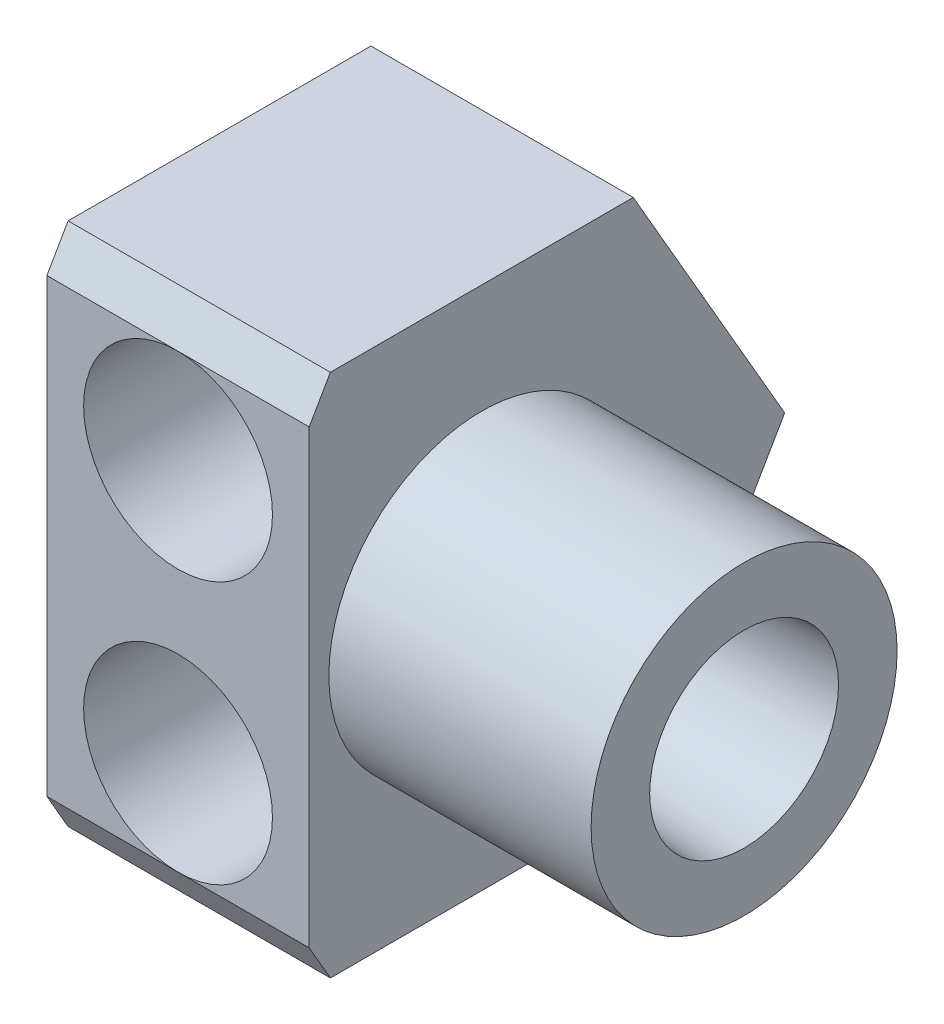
ISO-10303-21;
HEADER;
FILE_DESCRIPTION(('STEP AP214'),'2;1');
FILE_NAME('part.step','',(''),(''),'','','');
FILE_SCHEMA(('AUTOMOTIVE_DESIGN { 1 0 10303 214 1 1 1 1 }'));
ENDSEC;
DATA;
#1=APPLICATION_CONTEXT('core data for automotive mechanical design processes');
#2=APPLICATION_PROTOCOL_DEFINITION('international standard','automotive_design',2000,#1);
#3=PRODUCT_CONTEXT('',#1,'mechanical');
#4=PRODUCT('Part','Part','',(#3));
#5=PRODUCT_RELATED_PRODUCT_CATEGORY('part','',(#4));
#6=PRODUCT_DEFINITION_FORMATION('','',#4);
#7=PRODUCT_DEFINITION_CONTEXT('part definition',#1,'design');
#8=PRODUCT_DEFINITION('design','',#6,#7);
#9=PRODUCT_DEFINITION_SHAPE('','',#8);
#10=(LENGTH_UNIT() NAMED_UNIT(*) SI_UNIT(.MILLI.,.METRE.));
#11=(NAMED_UNIT(*) PLANE_ANGLE_UNIT() SI_UNIT($,.RADIAN.));
#12=(NAMED_UNIT(*) SI_UNIT($,.STERADIAN.) SOLID_ANGLE_UNIT());
#13=UNCERTAINTY_MEASURE_WITH_UNIT(LENGTH_MEASURE(1.E-05),#10,'distance_accuracy_value','');
#14=(GEOMETRIC_REPRESENTATION_CONTEXT(3) GLOBAL_UNCERTAINTY_ASSIGNED_CONTEXT((#13)) GLOBAL_UNIT_ASSIGNED_CONTEXT((#10,
#11,#12)) REPRESENTATION_CONTEXT('',''));
#15=CARTESIAN_POINT('',(0.,0.,0.));
#16=DIRECTION('',(0.,0.,1.));
#17=DIRECTION('',(1.,0.,0.));
#18=AXIS2_PLACEMENT_3D('',#15,#16,#17);
#19=CARTESIAN_POINT('',(9.525,9.525,-5.01171935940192));
#20=DIRECTION('',(0.,0.,1.));
#21=DIRECTION('',(0.,-1.,0.));
#22=AXIS2_PLACEMENT_3D('',#19,#20,#21);
#23=CONICAL_SURFACE('',#22,5.83094591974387,1.02747003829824);
#24=CARTESIAN_POINT('',(9.525,9.52500000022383,-8.53337833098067));
#25=VERTEX_POINT('',#24);
#26=VERTEX_LOOP('',#25);
#27=FACE_BOUND('',#26,.T.);
#28=CARTESIAN_POINT('',(9.525,9.525,-5.01171935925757));
#29=DIRECTION('',(0.,0.,1.));
#30=DIRECTION('',(0.,-1.,0.));
#31=AXIS2_PLACEMENT_3D('',#28,#29,#30);
#32=CIRCLE('',#31,5.83094591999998);
#33=CARTESIAN_POINT('',(9.525,3.69405408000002,-5.01171935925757));
#34=VERTEX_POINT('',#33);
#35=EDGE_CURVE('E189',#34,#34,#32,.T.);
#36=ORIENTED_EDGE('',*,*,#35,.T.);
#37=EDGE_LOOP('',(#36));
#38=FACE_BOUND('',#37,.T.);
#39=ADVANCED_FACE('F16',(#27,#38),#23,.F.);
#40=CARTESIAN_POINT('',(9.525,-9.525,-5.01171937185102));
#41=DIRECTION('',(0.,0.,1.));
#42=DIRECTION('',(1.,0.,0.));
#43=AXIS2_PLACEMENT_3D('',#40,#41,#42);
#44=CONICAL_SURFACE('',#43,5.8309459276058,1.02747003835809);
#45=CARTESIAN_POINT('',(9.525,-9.525,-8.53337834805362));
#46=VERTEX_POINT('',#45);
#47=VERTEX_LOOP('',#46);
#48=FACE_BOUND('',#47,.T.);
#49=CARTESIAN_POINT('',(9.525,-9.525,-5.01171935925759));
#50=DIRECTION('',(0.,0.,-1.));
#51=DIRECTION('',(0.,1.,0.));
#52=AXIS2_PLACEMENT_3D('',#49,#50,#51);
#53=CIRCLE('',#52,5.83094592);
#54=CARTESIAN_POINT('',(9.525,-3.69405408,-5.01171935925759));
#55=VERTEX_POINT('',#54);
#56=EDGE_CURVE('E186',#55,#55,#53,.F.);
#57=ORIENTED_EDGE('',*,*,#56,.T.);
#58=EDGE_LOOP('',(#57));
#59=FACE_BOUND('',#58,.T.);
#60=ADVANCED_FACE('F375',(#48,#59),#44,.F.);
#61=CARTESIAN_POINT('',(9.525,9.525,20.8181197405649));
#62=DIRECTION('',(0.,0.,1.));
#63=DIRECTION('',(0.,-1.,0.));
#64=AXIS2_PLACEMENT_3D('',#61,#62,#63);
#65=CYLINDRICAL_SURFACE('',#64,5.83094591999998);
#66=CARTESIAN_POINT('',(9.525,9.525,-2.56732186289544));
#67=DIRECTION('',(0.,0.,1.));
#68=DIRECTION('',(0.,-1.,0.));
#69=AXIS2_PLACEMENT_3D('',#66,#67,#68);
#70=CIRCLE('',#69,5.83094591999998);
#71=CARTESIAN_POINT('',(9.525,3.69405408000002,-2.56732186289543));
#72=VERTEX_POINT('',#71);
#73=EDGE_CURVE('E19',#72,#72,#70,.F.);
#74=ORIENTED_EDGE('',*,*,#73,.F.);
#75=EDGE_LOOP('',(#74));
#76=FACE_BOUND('',#75,.T.);
#77=ORIENTED_EDGE('',*,*,#35,.F.);
#78=EDGE_LOOP('',(#77));
#79=FACE_BOUND('',#78,.T.);
#80=ADVANCED_FACE('F273',(#76,#79),#65,.F.);
#81=CARTESIAN_POINT('',(9.525,-9.525,20.8181197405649));
#82=DIRECTION('',(0.,0.,-1.));
#83=DIRECTION('',(0.,1.,0.));
#84=AXIS2_PLACEMENT_3D('',#81,#82,#83);
#85=CYLINDRICAL_SURFACE('',#84,5.83094592);
#86=CARTESIAN_POINT('',(9.525,-9.525,-2.56732186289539));
#87=DIRECTION('',(0.,0.,-1.));
#88=DIRECTION('',(0.,1.,0.));
#89=AXIS2_PLACEMENT_3D('',#86,#87,#88);
#90=CIRCLE('',#89,5.83094592);
#91=CARTESIAN_POINT('',(9.525,-3.69405408,-2.56732186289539));
#92=VERTEX_POINT('',#91);
#93=EDGE_CURVE('E180',#92,#92,#90,.T.);
#94=ORIENTED_EDGE('',*,*,#93,.F.);
#95=EDGE_LOOP('',(#94));
#96=FACE_BOUND('',#95,.T.);
#97=ORIENTED_EDGE('',*,*,#56,.F.);
#98=EDGE_LOOP('',(#97));
#99=FACE_BOUND('',#98,.T.);
#100=ADVANCED_FACE('F262',(#96,#99),#85,.F.);
#101=CARTESIAN_POINT('',(9.525,15.3559459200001,-2.56732186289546));
#102=DIRECTION('',(0.,0.,1.));
#103=DIRECTION('',(1.,0.,0.));
#104=AXIS2_PLACEMENT_3D('',#101,#102,#103);
#105=PLANE('',#104);
#106=ORIENTED_EDGE('',*,*,#73,.T.);
#107=EDGE_LOOP('',(#106));
#108=FACE_BOUND('',#107,.T.);
#109=DIRECTION('',(1.,0.,0.));
#110=VECTOR('',#109,1.);
#111=CARTESIAN_POINT('',(57.,3.02652193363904,-2.56732186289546));
#112=LINE('',#111,#110);
#113=CARTESIAN_POINT('',(7.33366551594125,3.026521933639,-2.56732186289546));
#114=VERTEX_POINT('',#113);
#115=CARTESIAN_POINT('',(11.7163344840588,3.02652193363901,-2.5673218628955));
#116=VERTEX_POINT('',#115);
#117=EDGE_CURVE('E126',#114,#116,#112,.T.);
#118=ORIENTED_EDGE('',*,*,#117,.T.);
#119=CARTESIAN_POINT('',(9.525,9.525,-2.56732186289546));
#120=DIRECTION('',(0.,0.,1.));
#121=DIRECTION('',(0.,-1.,0.));
#122=AXIS2_PLACEMENT_3D('',#119,#120,#121);
#123=CIRCLE('',#122,6.858);
#124=EDGE_CURVE('E254',#116,#114,#123,.T.);
#125=ORIENTED_EDGE('',*,*,#124,.T.);
#126=EDGE_LOOP('',(#118,#125));
#127=FACE_BOUND('',#126,.T.);
#128=ADVANCED_FACE('F258',(#108,#127),#105,.T.);
#129=CARTESIAN_POINT('',(9.525,-2.667,-2.56732186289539));
#130=DIRECTION('',(0.,0.,1.));
#131=DIRECTION('',(1.,0.,0.));
#132=AXIS2_PLACEMENT_3D('',#129,#130,#131);
#133=PLANE('',#132);
#134=ORIENTED_EDGE('',*,*,#93,.T.);
#135=EDGE_LOOP('',(#134));
#136=FACE_BOUND('',#135,.T.);
#137=DIRECTION('',(1.,0.,0.));
#138=VECTOR('',#137,1.);
#139=CARTESIAN_POINT('',(57.,-3.0265219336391,-2.56732186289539));
#140=LINE('',#139,#138);
#141=CARTESIAN_POINT('',(11.7163344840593,-3.0265219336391,-2.56732186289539));
#142=VERTEX_POINT('',#141);
#143=CARTESIAN_POINT('',(7.33366551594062,-3.02652193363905,-2.56732186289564));
#144=VERTEX_POINT('',#143);
#145=EDGE_CURVE('E127',#142,#144,#140,.F.);
#146=ORIENTED_EDGE('',*,*,#145,.T.);
#147=CARTESIAN_POINT('',(9.525,-9.525,-2.56732186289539));
#148=DIRECTION('',(0.,0.,1.));
#149=DIRECTION('',(0.,-1.,0.));
#150=AXIS2_PLACEMENT_3D('',#147,#148,#149);
#151=CIRCLE('',#150,6.85800000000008);
#152=EDGE_CURVE('E130',#144,#142,#151,.T.);
#153=ORIENTED_EDGE('',*,*,#152,.T.);
#154=EDGE_LOOP('',(#146,#153));
#155=FACE_BOUND('',#154,.T.);
#156=ADVANCED_FACE('F261',(#136,#155),#133,.T.);
#157=CARTESIAN_POINT('',(6.35,-3.96874999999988,0.));
#158=DIRECTION('',(-1.,0.,0.));
#159=DIRECTION('',(0.,0.,1.));
#160=AXIS2_PLACEMENT_3D('',#157,#158,#159);
#161=PLANE('',#160);
#162=CARTESIAN_POINT('',(6.35,0.,0.));
#163=DIRECTION('',(1.,0.,0.));
#164=DIRECTION('',(0.,0.,-1.));
#165=AXIS2_PLACEMENT_3D('',#162,#163,#164);
#166=CIRCLE('',#165,3.9687499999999);
#167=CARTESIAN_POINT('',(6.35,-3.44622224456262,-1.96838228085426));
#168=VERTEX_POINT('',#167);
#169=CARTESIAN_POINT('',(6.35,3.44622224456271,-1.96838228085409));
#170=VERTEX_POINT('',#169);
#171=EDGE_CURVE('E105',#168,#170,#166,.T.);
#172=ORIENTED_EDGE('',*,*,#171,.T.);
#173=DIRECTION('',(0.,0.,1.));
#174=VECTOR('',#173,1.);
#175=CARTESIAN_POINT('',(6.35,3.44622224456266,20.8181197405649));
#176=LINE('',#175,#174);
#177=CARTESIAN_POINT('',(6.35,3.44622224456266,1.96838228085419));
#178=VERTEX_POINT('',#177);
#179=EDGE_CURVE('E177',#170,#178,#176,.T.);
#180=ORIENTED_EDGE('',*,*,#179,.T.);
#181=CARTESIAN_POINT('',(6.35,0.,0.));
#182=DIRECTION('',(1.,0.,0.));
#183=DIRECTION('',(0.,0.,-1.));
#184=AXIS2_PLACEMENT_3D('',#181,#182,#183);
#185=CIRCLE('',#184,3.9687499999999);
#186=CARTESIAN_POINT('',(6.35,-3.44622224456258,1.96838228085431));
#187=VERTEX_POINT('',#186);
#188=EDGE_CURVE('E108',#178,#187,#185,.T.);
#189=ORIENTED_EDGE('',*,*,#188,.T.);
#190=DIRECTION('',(0.,0.,1.));
#191=VECTOR('',#190,1.);
#192=CARTESIAN_POINT('',(6.35,-3.44622224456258,20.8181197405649));
#193=LINE('',#192,#191);
#194=EDGE_CURVE('E102',#187,#168,#193,.F.);
#195=ORIENTED_EDGE('',*,*,#194,.T.);
#196=EDGE_LOOP('',(#172,#180,#189,#195));
#197=FACE_BOUND('',#196,.T.);
#198=ADVANCED_FACE('F104',(#197),#161,.F.);
#199=CARTESIAN_POINT('',(57.,0.,0.));
#200=DIRECTION('',(1.,0.,0.));
#201=DIRECTION('',(0.,0.,-1.));
#202=AXIS2_PLACEMENT_3D('',#199,#200,#201);
#203=CYLINDRICAL_SURFACE('',#202,3.9687499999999);
#204=ORIENTED_EDGE('',*,*,#188,.F.);
#205=CARTESIAN_POINT('',(6.34999999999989,3.4462222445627,1.96838228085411));
#206=CARTESIAN_POINT('',(6.42515713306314,3.40693161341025,2.03713783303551));
#207=CARTESIAN_POINT('',(6.50414654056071,3.3674824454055,2.10146089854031));
#208=CARTESIAN_POINT('',(6.6685923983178,3.28951715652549,2.22153140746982));
#209=CARTESIAN_POINT('',(6.75403718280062,3.25099951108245,2.27729379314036));
#210=CARTESIAN_POINT('',(6.92973958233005,3.17631043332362,2.38034439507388));
#211=CARTESIAN_POINT('',(7.01995154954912,3.14012223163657,2.4276988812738));
#212=CARTESIAN_POINT('',(7.20495447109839,3.07059725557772,2.51506044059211));
#213=CARTESIAN_POINT('',(7.29974741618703,3.03726173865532,2.55506428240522));
#214=CARTESIAN_POINT('',(7.49238549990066,2.97436319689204,2.62801125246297));
#215=CARTESIAN_POINT('',(7.59020498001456,2.94477566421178,2.66100132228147));
#216=CARTESIAN_POINT('',(7.78884612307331,2.88959759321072,2.72081946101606));
#217=CARTESIAN_POINT('',(7.88966900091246,2.86400869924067,2.74764499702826));
#218=CARTESIAN_POINT('',(8.09385243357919,2.81717066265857,2.79564890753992));
#219=CARTESIAN_POINT('',(8.19721758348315,2.79593014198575,2.81681608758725));
#220=CARTESIAN_POINT('',(8.40573998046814,2.75812086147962,2.85384733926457));
#221=CARTESIAN_POINT('',(8.51089742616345,2.74155262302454,2.86971081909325));
#222=CARTESIAN_POINT('',(8.74185842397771,2.71069207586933,2.89890671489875));
#223=CARTESIAN_POINT('',(8.86791899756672,2.69737092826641,2.91124488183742));
#224=CARTESIAN_POINT('',(9.12105709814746,2.67772928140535,2.92932050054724));
#225=CARTESIAN_POINT('',(9.24813471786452,2.67140942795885,2.93505734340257));
#226=CARTESIAN_POINT('',(9.50267382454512,2.66585413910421,2.94010426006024));
#227=CARTESIAN_POINT('',(9.63013553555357,2.66662430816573,2.93940924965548));
#228=CARTESIAN_POINT('',(9.88461882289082,2.67525184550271,2.93155876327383));
#229=CARTESIAN_POINT('',(10.0116403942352,2.6831092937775,2.92440321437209));
#230=CARTESIAN_POINT('',(10.2790041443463,2.70710787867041,2.90221411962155));
#231=CARTESIAN_POINT('',(10.4192054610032,2.72409480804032,2.88637204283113));
#232=CARTESIAN_POINT('',(10.6970806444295,2.76643920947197,2.84581274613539));
#233=CARTESIAN_POINT('',(10.8347539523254,2.79179850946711,2.82109358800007));
#234=CARTESIAN_POINT('',(11.1061227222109,2.85031246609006,2.76196023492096));
#235=CARTESIAN_POINT('',(11.2398233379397,2.88345647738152,2.72755926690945));
#236=CARTESIAN_POINT('',(11.5019715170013,2.95672494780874,2.64795811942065));
#237=CARTESIAN_POINT('',(11.6304218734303,2.99684563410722,2.60276377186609));
#238=CARTESIAN_POINT('',(11.8390250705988,3.06858517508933,2.51729050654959));
#239=CARTESIAN_POINT('',(11.9210950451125,3.09862434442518,2.48033352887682));
#240=CARTESIAN_POINT('',(12.0815636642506,3.16076082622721,2.40065034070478));
#241=CARTESIAN_POINT('',(12.1599632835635,3.19285758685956,2.35792567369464));
#242=CARTESIAN_POINT('',(12.3123768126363,3.25845661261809,2.26640685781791));
#243=CARTESIAN_POINT('',(12.3863964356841,3.29195694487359,2.21762088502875));
#244=CARTESIAN_POINT('',(12.5294582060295,3.35963971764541,2.11368008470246));
#245=CARTESIAN_POINT('',(12.5985011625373,3.39382204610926,2.05852629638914));
#246=CARTESIAN_POINT('',(12.7734163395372,3.48390429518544,1.90413286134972));
#247=CARTESIAN_POINT('',(12.8745291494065,3.53968095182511,1.79929506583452));
#248=CARTESIAN_POINT('',(13.0582432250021,3.64625143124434,1.57209664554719));
#249=CARTESIAN_POINT('',(13.1408485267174,3.69704633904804,1.44973985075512));
#250=CARTESIAN_POINT('',(13.2488989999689,3.76595540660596,1.25435421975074));
#251=CARTESIAN_POINT('',(13.2823726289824,3.78778232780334,1.1869625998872));
#252=CARTESIAN_POINT('',(13.3435984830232,3.82835053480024,1.04875350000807));
#253=CARTESIAN_POINT('',(13.3713533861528,3.84709326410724,0.977937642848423));
#254=CARTESIAN_POINT('',(13.4208899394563,3.88096678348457,0.833413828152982));
#255=CARTESIAN_POINT('',(13.4426722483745,3.89609797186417,0.759706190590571));
#256=CARTESIAN_POINT('',(13.4800756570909,3.92231725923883,0.610070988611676));
#257=CARTESIAN_POINT('',(13.4956975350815,3.93340586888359,0.534143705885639));
#258=CARTESIAN_POINT('',(13.5301528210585,3.95798056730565,0.322197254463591));
#259=CARTESIAN_POINT('',(13.5423646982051,3.96685643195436,0.184469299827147));
#260=CARTESIAN_POINT('',(13.5468432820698,3.97009758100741,-0.0913713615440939));
#261=CARTESIAN_POINT('',(13.5391176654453,3.96446845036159,-0.229483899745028));
#262=CARTESIAN_POINT('',(13.5048355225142,3.93988793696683,-0.495154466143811));
#263=CARTESIAN_POINT('',(13.4792225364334,3.92160447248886,-0.622897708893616));
#264=CARTESIAN_POINT('',(13.4108140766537,3.87395276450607,-0.871489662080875));
#265=CARTESIAN_POINT('',(13.3680187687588,3.84458462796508,-0.992338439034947));
#266=CARTESIAN_POINT('',(13.264872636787,3.77613649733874,-1.22769043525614));
#267=CARTESIAN_POINT('',(13.2040563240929,3.7368036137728,-1.34191471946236));
#268=CARTESIAN_POINT('',(13.0670355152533,3.6519576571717,-1.55810478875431));
#269=CARTESIAN_POINT('',(12.9908287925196,3.60644369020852,-1.66006879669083));
#270=CARTESIAN_POINT('',(12.8164238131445,3.50754841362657,-1.86060527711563));
#271=CARTESIAN_POINT('',(12.7167673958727,3.45383999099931,-1.957740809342));
#272=CARTESIAN_POINT('',(12.5038287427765,3.34657228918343,-2.13594935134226));
#273=CARTESIAN_POINT('',(12.390530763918,3.2930132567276,-2.21700351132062));
#274=CARTESIAN_POINT('',(12.1843152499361,3.20286869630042,-2.34457202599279));
#275=CARTESIAN_POINT('',(12.0938425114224,3.16551467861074,-2.3945704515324));
#276=CARTESIAN_POINT('',(11.9083388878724,3.09368570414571,-2.48665042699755));
#277=CARTESIAN_POINT('',(11.8133268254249,3.05920024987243,-2.52876161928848));
#278=CARTESIAN_POINT('',(11.7163344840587,3.02652193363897,-2.56732186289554));
#279=B_SPLINE_CURVE_WITH_KNOTS('',3,(#205,#206,#207,#208,#209,#210,#211,#212,#213,#214,#215,
#216,#217,#218,#219,#220,#221,#222,#223,#224,#225,#226,#227,#228,#229,#230,#231,#232,#233,#234,
#235,#236,#237,#238,#239,#240,#241,#242,#243,#244,#245,#246,#247,#248,#249,#250,#251,#252,#253,
#254,#255,#256,#257,#258,#259,#260,#261,#262,#263,#264,#265,#266,#267,#268,#269,#270,#271,#272,
#273,#274,#275,#276,#277,#278),.UNSPECIFIED.,.F.,.F.,(4,2,2,2,2,2,2,2,2,2,2,2,2,2,2,2,2,2,2,2,2,
2,2,2,2,2,2,2,2,2,2,2,2,2,2,2,4),(0.,0.327238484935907,0.653899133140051,0.977858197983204,
1.30195933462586,1.62381783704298,1.9458083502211,2.26843125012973,2.59109013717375,
2.97278833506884,3.35452173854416,3.73655691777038,4.11859640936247,4.54439848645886,
4.97029359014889,5.39560965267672,5.82069642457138,6.10512352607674,6.38947466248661,
6.67344632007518,6.95737169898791,7.423285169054,7.88909693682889,8.12385213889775,
8.35849715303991,8.59311627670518,8.82770575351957,9.24102925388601,9.65419363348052,
10.0470649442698,10.4399324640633,10.8439945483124,11.2481151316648,11.693957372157,
12.1403191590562,12.4696512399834,12.7977196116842),.UNSPECIFIED.);
#280=EDGE_CURVE('E171',#178,#116,#279,.T.);
#281=ORIENTED_EDGE('',*,*,#280,.T.);
#282=ORIENTED_EDGE('',*,*,#117,.F.);
#283=CARTESIAN_POINT('',(7.33366551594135,3.02652193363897,-2.56732186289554));
#284=CARTESIAN_POINT('',(7.242316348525,3.05730293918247,-2.53100715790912));
#285=CARTESIAN_POINT('',(7.15271245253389,3.08968601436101,-2.49153476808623));
#286=CARTESIAN_POINT('',(6.97844157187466,3.15665779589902,-2.40612741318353));
#287=CARTESIAN_POINT('',(6.89374253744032,3.1912280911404,-2.36024326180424));
#288=CARTESIAN_POINT('',(6.72930956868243,3.26207025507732,-2.2613199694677));
#289=CARTESIAN_POINT('',(6.64957693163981,3.2983425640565,-2.20827897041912));
#290=CARTESIAN_POINT('',(6.49539224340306,3.37186468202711,-2.09430647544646));
#291=CARTESIAN_POINT('',(6.42098478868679,3.40911981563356,-2.0333182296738));
#292=CARTESIAN_POINT('',(6.34999999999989,3.4462222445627,-1.96838228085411));
#293=B_SPLINE_CURVE_WITH_KNOTS('',3,(#283,#284,#285,#286,#287,#288,#289,#290,#291,#292),
.UNSPECIFIED.,.F.,.F.,(4,2,2,2,4),(0.,0.309017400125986,0.615711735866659,0.922485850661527,
1.23158476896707),.UNSPECIFIED.);
#294=EDGE_CURVE('E124',#114,#170,#293,.T.);
#295=ORIENTED_EDGE('',*,*,#294,.T.);
#296=ORIENTED_EDGE('',*,*,#171,.F.);
#297=CARTESIAN_POINT('',(6.34999999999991,-3.44622224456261,-1.96838228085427));
#298=CARTESIAN_POINT('',(6.42098478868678,-3.40911981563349,-2.03331822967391));
#299=CARTESIAN_POINT('',(6.495392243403,-3.37186468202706,-2.09430647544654));
#300=CARTESIAN_POINT('',(6.64957693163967,-3.29834256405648,-2.20827897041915));
#301=CARTESIAN_POINT('',(6.72930956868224,-3.26207025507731,-2.26131996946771));
#302=CARTESIAN_POINT('',(6.89374253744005,-3.19122809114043,-2.36024326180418));
#303=CARTESIAN_POINT('',(6.97844157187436,-3.15665779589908,-2.40612741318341));
#304=CARTESIAN_POINT('',(7.15271245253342,-3.08968601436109,-2.49153476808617));
#305=CARTESIAN_POINT('',(7.24231634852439,-3.05730293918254,-2.53100715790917));
#306=CARTESIAN_POINT('',(7.33366551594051,-3.02652193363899,-2.5673218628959));
#307=B_SPLINE_CURVE_WITH_KNOTS('',3,(#297,#298,#299,#300,#301,#302,#303,#304,#305,#306),
.UNSPECIFIED.,.F.,.F.,(4,2,2,2,4),(0.,0.309098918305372,0.615873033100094,0.922567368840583,
1.23158476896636),.UNSPECIFIED.);
#308=EDGE_CURVE('E113',#168,#144,#307,.T.);
#309=ORIENTED_EDGE('',*,*,#308,.T.);
#310=ORIENTED_EDGE('',*,*,#145,.F.);
#311=CARTESIAN_POINT('',(11.7163344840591,-3.02652193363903,-2.56732186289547));
#312=CARTESIAN_POINT('',(11.7961935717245,-3.05343673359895,-2.53557582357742));
#313=CARTESIAN_POINT('',(11.8747144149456,-3.08156773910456,-2.50141732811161));
#314=CARTESIAN_POINT('',(12.0286333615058,-3.13980523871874,-2.42792589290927));
#315=CARTESIAN_POINT('',(12.1040284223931,-3.16991358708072,-2.38858806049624));
#316=CARTESIAN_POINT('',(12.251779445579,-3.23188260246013,-2.30405638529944));
#317=CARTESIAN_POINT('',(12.3241006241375,-3.26375696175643,-2.25881148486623));
#318=CARTESIAN_POINT('',(12.4643354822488,-3.32835368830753,-2.16249866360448));
#319=CARTESIAN_POINT('',(12.5322503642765,-3.36107582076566,-2.11143234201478));
#320=CARTESIAN_POINT('',(12.663517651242,-3.42686106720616,-2.0029107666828));
#321=CARTESIAN_POINT('',(12.7268355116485,-3.45992497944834,-1.94541403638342));
#322=CARTESIAN_POINT('',(12.8477179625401,-3.52529744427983,-1.8242774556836));
#323=CARTESIAN_POINT('',(12.9052837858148,-3.55760615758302,-1.76063892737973));
#324=CARTESIAN_POINT('',(13.0138339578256,-3.62041517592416,-1.62756355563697));
#325=CARTESIAN_POINT('',(13.0648407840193,-3.65092145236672,-1.55814793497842));
#326=CARTESIAN_POINT('',(13.1598662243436,-3.70924384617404,-1.41369880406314));
#327=CARTESIAN_POINT('',(13.203890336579,-3.73706207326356,-1.33866978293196));
#328=CARTESIAN_POINT('',(13.2795795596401,-3.78591688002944,-1.19288930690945));
#329=CARTESIAN_POINT('',(13.3120953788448,-3.80736674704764,-1.12271735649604));
#330=CARTESIAN_POINT('',(13.3710200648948,-3.8468355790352,-0.978970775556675));
#331=CARTESIAN_POINT('',(13.3974325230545,-3.86485656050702,-0.905398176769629));
#332=CARTESIAN_POINT('',(13.4439343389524,-3.89695233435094,-0.755393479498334));
#333=CARTESIAN_POINT('',(13.4640204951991,-3.9110251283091,-0.678959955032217));
#334=CARTESIAN_POINT('',(13.4976640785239,-3.93478354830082,-0.524033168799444));
#335=CARTESIAN_POINT('',(13.5112224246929,-3.94446979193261,-0.445540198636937));
#336=CARTESIAN_POINT('',(13.5389167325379,-3.96432025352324,-0.231242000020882));
#337=CARTESIAN_POINT('',(13.546697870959,-3.96999064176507,-0.0941114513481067));
#338=CARTESIAN_POINT('',(13.5426290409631,-3.96704940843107,0.179560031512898));
#339=CARTESIAN_POINT('',(13.5307911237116,-3.95844655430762,0.316101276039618));
#340=CARTESIAN_POINT('',(13.4887394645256,-3.92843376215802,0.578916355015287));
#341=CARTESIAN_POINT('',(13.4593149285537,-3.90757447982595,0.705380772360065));
#342=CARTESIAN_POINT('',(13.3834917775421,-3.8552283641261,0.950758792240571));
#343=CARTESIAN_POINT('',(13.3370922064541,-3.82374093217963,1.06967196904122));
#344=CARTESIAN_POINT('',(13.2265240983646,-3.75131986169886,1.3014837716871));
#345=CARTESIAN_POINT('',(13.1617731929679,-3.7100855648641,1.41400890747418));
#346=CARTESIAN_POINT('',(13.0170701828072,-3.62205421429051,1.62632537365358));
#347=CARTESIAN_POINT('',(12.9371139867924,-3.57525566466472,1.72611326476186));
#348=CARTESIAN_POINT('',(12.7543428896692,-3.47391836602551,1.92261152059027));
#349=CARTESIAN_POINT('',(12.6499697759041,-3.4191003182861,2.01772026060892));
#350=CARTESIAN_POINT('',(12.427848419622,-3.31042632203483,2.19148126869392));
#351=CARTESIAN_POINT('',(12.3100891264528,-3.25657121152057,2.27011978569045));
#352=CARTESIAN_POINT('',(12.0950463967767,-3.16598726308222,2.39412096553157));
#353=CARTESIAN_POINT('',(12.0000593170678,-3.1283569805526,2.44287884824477));
#354=CARTESIAN_POINT('',(11.8051805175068,-3.05632723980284,2.53241886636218));
#355=CARTESIAN_POINT('',(11.705286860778,-3.02192907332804,2.57319781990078));
#356=CARTESIAN_POINT('',(11.5014317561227,-2.95709749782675,2.64744845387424));
#357=CARTESIAN_POINT('',(11.397465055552,-2.92666944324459,2.68091030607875));
#358=CARTESIAN_POINT('',(11.1864087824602,-2.87039157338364,2.74108100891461));
#359=CARTESIAN_POINT('',(11.0793194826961,-2.84454135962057,2.76779044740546));
#360=CARTESIAN_POINT('',(10.8607886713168,-2.79740379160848,2.815430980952));
#361=CARTESIAN_POINT('',(10.749303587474,-2.77620618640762,2.83625034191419));
#362=CARTESIAN_POINT('',(10.5244983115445,-2.73926903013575,2.87194021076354));
#363=CARTESIAN_POINT('',(10.4111780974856,-2.723529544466,2.88681064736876));
#364=CARTESIAN_POINT('',(10.183305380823,-2.69770577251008,2.9109573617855));
#365=CARTESIAN_POINT('',(10.0687528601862,-2.68762156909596,2.92023355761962));
#366=CARTESIAN_POINT('',(9.83897572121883,-2.67322368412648,2.93341867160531));
#367=CARTESIAN_POINT('',(9.7237510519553,-2.66891044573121,2.93732717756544));
#368=CARTESIAN_POINT('',(9.47034011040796,-2.6658275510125,2.94012800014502));
#369=CARTESIAN_POINT('',(9.33212255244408,-2.66832393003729,2.9378745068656));
#370=CARTESIAN_POINT('',(9.05640096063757,-2.68163574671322,2.92572828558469));
#371=CARTESIAN_POINT('',(8.91889706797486,-2.69245277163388,2.91583410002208));
#372=CARTESIAN_POINT('',(8.64550407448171,-2.72223820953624,2.88804631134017));
#373=CARTESIAN_POINT('',(8.50961592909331,-2.74121122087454,2.87014819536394));
#374=CARTESIAN_POINT('',(8.24060500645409,-2.78696670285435,2.8257411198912));
#375=CARTESIAN_POINT('',(8.10748145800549,-2.81374696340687,2.79923459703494));
#376=CARTESIAN_POINT('',(7.87178575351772,-2.86838121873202,2.74309412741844));
#377=CARTESIAN_POINT('',(7.7684938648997,-2.89491553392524,2.71518517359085));
#378=CARTESIAN_POINT('',(7.56510130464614,-2.95216845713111,2.65282330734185));
#379=CARTESIAN_POINT('',(7.46499995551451,-2.98288616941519,2.61837179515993));
#380=CARTESIAN_POINT('',(7.26907780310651,-3.04784075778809,2.54246525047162));
#381=CARTESIAN_POINT('',(7.17324373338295,-3.08206544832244,2.50103416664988));
#382=CARTESIAN_POINT('',(6.98641502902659,-3.15336399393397,2.41051609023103));
#383=CARTESIAN_POINT('',(6.89541789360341,-3.19043635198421,2.36143310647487));
#384=CARTESIAN_POINT('',(6.72563900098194,-3.26371966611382,2.25893472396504));
#385=CARTESIAN_POINT('',(6.64645063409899,-3.29979515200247,2.20609915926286));
#386=CARTESIAN_POINT('',(6.49371937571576,-3.37270243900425,2.09293353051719));
#387=CARTESIAN_POINT('',(6.42018860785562,-3.40953566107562,2.03258805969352));
#388=CARTESIAN_POINT('',(6.34999999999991,-3.44622224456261,1.96838228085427));
#389=B_SPLINE_CURVE_WITH_KNOTS('',3,(#311,#312,#313,#314,#315,#316,#317,#318,#319,#320,#321,
#322,#323,#324,#325,#326,#327,#328,#329,#330,#331,#332,#333,#334,#335,#336,#337,#338,#339,#340,
#341,#342,#343,#344,#345,#346,#347,#348,#349,#350,#351,#352,#353,#354,#355,#356,#357,#358,#359,
#360,#361,#362,#363,#364,#365,#366,#367,#368,#369,#370,#371,#372,#373,#374,#375,#376,#377,#378,
#379,#380,#381,#382,#383,#384,#385,#386,#387,#388),.UNSPECIFIED.,.F.,.F.,(4,2,2,2,2,2,2,2,2,2,2,
2,2,2,2,2,2,2,2,2,2,2,2,2,2,2,2,2,2,2,2,2,2,2,2,2,2,2,4),(0.,0.270152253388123,
0.540561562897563,0.813485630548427,1.08633490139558,1.36105839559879,1.63572288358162,
1.90941948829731,2.18289950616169,2.4233162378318,2.66359114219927,2.90398744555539,
3.14434989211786,3.554468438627,3.96433515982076,4.35706071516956,4.74980839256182,
5.15677178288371,5.5638448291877,6.01659326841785,6.46971821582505,6.8089115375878,
7.14823984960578,7.4880211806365,7.82777292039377,8.17359328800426,8.51941779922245,
8.86524737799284,9.21110351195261,9.6254062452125,10.0397880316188,10.4544037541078,
10.8689022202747,11.1993226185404,11.5296723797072,11.8589108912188,12.1879774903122,
12.4929649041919,12.7985886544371),.UNSPECIFIED.);
#390=EDGE_CURVE('E114',#142,#187,#389,.T.);
#391=ORIENTED_EDGE('',*,*,#390,.T.);
#392=EDGE_LOOP('',(#204,#281,#282,#295,#296,#309,#310,#391));
#393=FACE_BOUND('',#392,.T.);
#394=CARTESIAN_POINT('',(27.7876,0.,0.));
#395=DIRECTION('',(1.,0.,0.));
#396=DIRECTION('',(0.,0.,-1.));
#397=AXIS2_PLACEMENT_3D('',#394,#395,#396);
#398=CIRCLE('',#397,3.9687499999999);
#399=CARTESIAN_POINT('',(27.7876,0.,-3.9687499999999));
#400=VERTEX_POINT('',#399);
#401=EDGE_CURVE('E131',#400,#400,#398,.T.);
#402=ORIENTED_EDGE('',*,*,#401,.T.);
#403=EDGE_LOOP('',(#402));
#404=FACE_BOUND('',#403,.T.);
#405=ADVANCED_FACE('F118',(#393,#404),#203,.F.);
#406=CARTESIAN_POINT('',(9.525,9.525,20.8181197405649));
#407=DIRECTION('',(0.,0.,1.));
#408=DIRECTION('',(0.,-1.,0.));
#409=AXIS2_PLACEMENT_3D('',#406,#407,#408);
#410=CYLINDRICAL_SURFACE('',#409,6.858);
#411=CARTESIAN_POINT('',(9.525,9.525,12.538315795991));
#412=DIRECTION('',(0.,0.,1.));
#413=DIRECTION('',(0.,-1.,0.));
#414=AXIS2_PLACEMENT_3D('',#411,#412,#413);
#415=CIRCLE('',#414,6.858);
#416=CARTESIAN_POINT('',(9.525,2.667,12.538315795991));
#417=VERTEX_POINT('',#416);
#418=EDGE_CURVE('E218',#417,#417,#415,.F.);
#419=ORIENTED_EDGE('',*,*,#418,.F.);
#420=EDGE_LOOP('',(#419));
#421=FACE_BOUND('',#420,.T.);
#422=ORIENTED_EDGE('',*,*,#179,.F.);
#423=ORIENTED_EDGE('',*,*,#294,.F.);
#424=ORIENTED_EDGE('',*,*,#124,.F.);
#425=ORIENTED_EDGE('',*,*,#280,.F.);
#426=EDGE_LOOP('',(#422,#423,#424,#425));
#427=FACE_BOUND('',#426,.T.);
#428=ADVANCED_FACE('F156',(#421,#427),#410,.F.);
#429=CARTESIAN_POINT('',(9.525,-9.525,20.8181197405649));
#430=DIRECTION('',(0.,0.,1.));
#431=DIRECTION('',(0.,-1.,0.));
#432=AXIS2_PLACEMENT_3D('',#429,#430,#431);
#433=CYLINDRICAL_SURFACE('',#432,6.85800000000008);
#434=CARTESIAN_POINT('',(9.525,-9.525,12.5383157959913));
#435=DIRECTION('',(0.,0.,1.));
#436=DIRECTION('',(0.,-1.,0.));
#437=AXIS2_PLACEMENT_3D('',#434,#435,#436);
#438=CIRCLE('',#437,6.85800000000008);
#439=CARTESIAN_POINT('',(9.525,-16.3830000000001,12.5383157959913));
#440=VERTEX_POINT('',#439);
#441=EDGE_CURVE('E215',#440,#440,#438,.F.);
#442=ORIENTED_EDGE('',*,*,#441,.F.);
#443=EDGE_LOOP('',(#442));
#444=FACE_BOUND('',#443,.T.);
#445=ORIENTED_EDGE('',*,*,#194,.F.);
#446=ORIENTED_EDGE('',*,*,#390,.F.);
#447=ORIENTED_EDGE('',*,*,#152,.F.);
#448=ORIENTED_EDGE('',*,*,#308,.F.);
#449=EDGE_LOOP('',(#445,#446,#447,#448));
#450=FACE_BOUND('',#449,.T.);
#451=ADVANCED_FACE('F129',(#444,#450),#433,.F.);
#452=CARTESIAN_POINT('',(0.,-38.1,0.));
#453=DIRECTION('',(1.,0.,0.));
#454=DIRECTION('',(0.,0.,-1.));
#455=AXIS2_PLACEMENT_3D('',#452,#453,#454);
#456=PLANE('',#455);
#457=DIRECTION('',(0.,0.866025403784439,-0.5));
#458=VECTOR('',#457,1.);
#459=CARTESIAN_POINT('',(0.,19.05,10.9985226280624));
#460=LINE('',#459,#458);
#461=CARTESIAN_POINT('',(0.,16.3829999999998,12.5383157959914));
#462=VERTEX_POINT('',#461);
#463=CARTESIAN_POINT('',(0.,19.05,10.9985226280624));
#464=VERTEX_POINT('',#463);
#465=EDGE_CURVE('E134',#462,#464,#460,.T.);
#466=ORIENTED_EDGE('',*,*,#465,.T.);
#467=DIRECTION('',(0.,0.,-1.));
#468=VECTOR('',#467,1.);
#469=CARTESIAN_POINT('',(0.,19.05,-10.9985226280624));
#470=LINE('',#469,#468);
#471=CARTESIAN_POINT('',(0.,19.05,-10.9985226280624));
#472=VERTEX_POINT('',#471);
#473=EDGE_CURVE('E210',#464,#472,#470,.T.);
#474=ORIENTED_EDGE('',*,*,#473,.T.);
#475=DIRECTION('',(0.,-0.866025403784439,-0.5));
#476=VECTOR('',#475,1.);
#477=CARTESIAN_POINT('',(0.,0.,-21.9970452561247));
#478=LINE('',#477,#476);
#479=CARTESIAN_POINT('',(0.,0.,-21.9970452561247));
#480=VERTEX_POINT('',#479);
#481=EDGE_CURVE('E517',#472,#480,#478,.T.);
#482=ORIENTED_EDGE('',*,*,#481,.T.);
#483=DIRECTION('',(0.,-0.866025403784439,0.5));
#484=VECTOR('',#483,1.);
#485=CARTESIAN_POINT('',(0.,-19.05,-10.9985226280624));
#486=LINE('',#485,#484);
#487=CARTESIAN_POINT('',(0.,-19.05,-10.9985226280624));
#488=VERTEX_POINT('',#487);
#489=EDGE_CURVE('E512',#480,#488,#486,.T.);
#490=ORIENTED_EDGE('',*,*,#489,.T.);
#491=DIRECTION('',(0.,0.,1.));
#492=VECTOR('',#491,1.);
#493=CARTESIAN_POINT('',(0.,-19.05,10.9985226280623));
#494=LINE('',#493,#492);
#495=CARTESIAN_POINT('',(0.,-19.05,10.9985226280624));
#496=VERTEX_POINT('',#495);
#497=EDGE_CURVE('E246',#488,#496,#494,.T.);
#498=ORIENTED_EDGE('',*,*,#497,.T.);
#499=DIRECTION('',(0.,0.866025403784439,0.5));
#500=VECTOR('',#499,1.);
#501=CARTESIAN_POINT('',(0.,0.,21.9970452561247));
#502=LINE('',#501,#500);
#503=CARTESIAN_POINT('',(0.,-16.3829999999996,12.5383157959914));
#504=VERTEX_POINT('',#503);
#505=EDGE_CURVE('E214',#496,#504,#502,.T.);
#506=ORIENTED_EDGE('',*,*,#505,.T.);
#507=DIRECTION('',(0.,1.,0.));
#508=VECTOR('',#507,1.);
#509=CARTESIAN_POINT('',(0.,-16.383,12.5383157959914));
#510=LINE('',#509,#508);
#511=EDGE_CURVE('E221',#462,#504,#510,.F.);
#512=ORIENTED_EDGE('',*,*,#511,.F.);
#513=EDGE_LOOP('',(#466,#474,#482,#490,#498,#506,#512));
#514=FACE_BOUND('',#513,.T.);
#515=ADVANCED_FACE('F155',(#514),#456,.F.);
#516=CARTESIAN_POINT('',(27.7876,-6.31755001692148,0.));
#517=DIRECTION('',(-1.,0.,0.));
#518=DIRECTION('',(0.,0.,1.));
#519=AXIS2_PLACEMENT_3D('',#516,#517,#518);
#520=PLANE('',#519);
#521=ORIENTED_EDGE('',*,*,#401,.F.);
#522=EDGE_LOOP('',(#521));
#523=FACE_BOUND('',#522,.T.);
#524=CARTESIAN_POINT('',(27.7876000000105,0.,0.));
#525=DIRECTION('',(1.,0.,0.));
#526=DIRECTION('',(0.,0.,-1.));
#527=AXIS2_PLACEMENT_3D('',#524,#525,#526);
#528=CIRCLE('',#527,6.3175500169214);
#529=CARTESIAN_POINT('',(27.7876000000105,0.,-6.3175500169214));
#530=VERTEX_POINT('',#529);
#531=EDGE_CURVE('E207',#530,#530,#528,.T.);
#532=ORIENTED_EDGE('',*,*,#531,.T.);
#533=EDGE_LOOP('',(#532));
#534=FACE_BOUND('',#533,.T.);
#535=ADVANCED_FACE('F323',(#523,#534),#520,.F.);
#536=CARTESIAN_POINT('',(19.05,19.05,10.9985226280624));
#537=DIRECTION('',(0.,-0.5,-0.866025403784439));
#538=DIRECTION('',(0.,0.866025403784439,-0.5));
#539=AXIS2_PLACEMENT_3D('',#536,#537,#538);
#540=PLANE('',#539);
#541=DIRECTION('',(0.,-0.866025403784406,0.500000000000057));
#542=VECTOR('',#541,1.);
#543=CARTESIAN_POINT('',(19.05,19.05,10.9985226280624));
#544=LINE('',#543,#542);
#545=CARTESIAN_POINT('',(19.05,19.05,10.9985226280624));
#546=VERTEX_POINT('',#545);
#547=CARTESIAN_POINT('',(19.05,16.383,12.5383157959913));
#548=VERTEX_POINT('',#547);
#549=EDGE_CURVE('E206',#546,#548,#544,.T.);
#550=ORIENTED_EDGE('',*,*,#549,.F.);
#551=DIRECTION('',(1.,0.,0.));
#552=VECTOR('',#551,1.);
#553=CARTESIAN_POINT('',(19.05,19.05,10.9985226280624));
#554=LINE('',#553,#552);
#555=EDGE_CURVE('E239',#546,#464,#554,.F.);
#556=ORIENTED_EDGE('',*,*,#555,.T.);
#557=ORIENTED_EDGE('',*,*,#465,.F.);
#558=DIRECTION('',(1.,0.,0.));
#559=VECTOR('',#558,1.);
#560=CARTESIAN_POINT('',(61.2371823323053,16.383,12.5383157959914));
#561=LINE('',#560,#559);
#562=EDGE_CURVE('E223',#548,#462,#561,.F.);
#563=ORIENTED_EDGE('',*,*,#562,.F.);
#564=EDGE_LOOP('',(#550,#556,#557,#563));
#565=FACE_BOUND('',#564,.T.);
#566=ADVANCED_FACE('F320',(#565),#540,.F.);
#567=CARTESIAN_POINT('',(61.2371823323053,-16.383,12.5383157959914));
#568=DIRECTION('',(0.,0.,1.));
#569=DIRECTION('',(1.,0.,0.));
#570=AXIS2_PLACEMENT_3D('',#567,#568,#569);
#571=PLANE('',#570);
#572=ORIENTED_EDGE('',*,*,#441,.T.);
#573=EDGE_LOOP('',(#572));
#574=FACE_BOUND('',#573,.T.);
#575=ORIENTED_EDGE('',*,*,#418,.T.);
#576=EDGE_LOOP('',(#575));
#577=FACE_BOUND('',#576,.T.);
#578=DIRECTION('',(1.,0.,0.));
#579=VECTOR('',#578,1.);
#580=CARTESIAN_POINT('',(61.2371823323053,-16.383,12.5383157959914));
#581=LINE('',#580,#579);
#582=CARTESIAN_POINT('',(19.05,-16.383,12.5383157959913));
#583=VERTEX_POINT('',#582);
#584=EDGE_CURVE('E211',#504,#583,#581,.T.);
#585=ORIENTED_EDGE('',*,*,#584,.T.);
#586=DIRECTION('',(0.,1.,0.));
#587=VECTOR('',#586,1.);
#588=CARTESIAN_POINT('',(19.05,-38.1,12.5383157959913));
#589=LINE('',#588,#587);
#590=EDGE_CURVE('E202',#548,#583,#589,.F.);
#591=ORIENTED_EDGE('',*,*,#590,.F.);
#592=ORIENTED_EDGE('',*,*,#562,.T.);
#593=ORIENTED_EDGE('',*,*,#511,.T.);
#594=EDGE_LOOP('',(#585,#591,#592,#593));
#595=FACE_BOUND('',#594,.T.);
#596=ADVANCED_FACE('F316',(#574,#577,#595),#571,.T.);
#597=CARTESIAN_POINT('',(19.05,0.,21.9970452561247));
#598=DIRECTION('',(0.,0.5,-0.866025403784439));
#599=DIRECTION('',(0.,0.866025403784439,0.5));
#600=AXIS2_PLACEMENT_3D('',#597,#598,#599);
#601=PLANE('',#600);
#602=ORIENTED_EDGE('',*,*,#584,.F.);
#603=ORIENTED_EDGE('',*,*,#505,.F.);
#604=DIRECTION('',(1.,0.,0.));
#605=VECTOR('',#604,1.);
#606=CARTESIAN_POINT('',(19.05,-19.05,10.9985226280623));
#607=LINE('',#606,#605);
#608=CARTESIAN_POINT('',(19.05,-19.05,10.9985226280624));
#609=VERTEX_POINT('',#608);
#610=EDGE_CURVE('E213',#496,#609,#607,.T.);
#611=ORIENTED_EDGE('',*,*,#610,.T.);
#612=DIRECTION('',(0.,-0.866025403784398,-0.50000000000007));
#613=VECTOR('',#612,1.);
#614=CARTESIAN_POINT('',(19.05,-16.383,12.5383157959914));
#615=LINE('',#614,#613);
#616=EDGE_CURVE('E205',#583,#609,#615,.T.);
#617=ORIENTED_EDGE('',*,*,#616,.F.);
#618=EDGE_LOOP('',(#602,#603,#611,#617));
#619=FACE_BOUND('',#618,.T.);
#620=ADVANCED_FACE('F312',(#619),#601,.F.);
#621=CARTESIAN_POINT('',(19.05,-19.05,10.9985226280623));
#622=DIRECTION('',(0.,1.,0.));
#623=DIRECTION('',(0.,0.,1.));
#624=AXIS2_PLACEMENT_3D('',#621,#622,#623);
#625=PLANE('',#624);
#626=DIRECTION('',(1.,0.,0.));
#627=VECTOR('',#626,1.);
#628=CARTESIAN_POINT('',(19.05,-19.05,-10.9985226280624));
#629=LINE('',#628,#627);
#630=CARTESIAN_POINT('',(19.05,-19.05,-10.9985226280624));
#631=VERTEX_POINT('',#630);
#632=EDGE_CURVE('E249',#488,#631,#629,.T.);
#633=ORIENTED_EDGE('',*,*,#632,.T.);
#634=DIRECTION('',(0.,0.,-1.));
#635=VECTOR('',#634,1.);
#636=CARTESIAN_POINT('',(19.05,-19.05,0.));
#637=LINE('',#636,#635);
#638=EDGE_CURVE('E508',#609,#631,#637,.T.);
#639=ORIENTED_EDGE('',*,*,#638,.F.);
#640=ORIENTED_EDGE('',*,*,#610,.F.);
#641=ORIENTED_EDGE('',*,*,#497,.F.);
#642=EDGE_LOOP('',(#633,#639,#640,#641));
#643=FACE_BOUND('',#642,.T.);
#644=ADVANCED_FACE('F308',(#643),#625,.F.);
#645=CARTESIAN_POINT('',(19.05,-19.05,-10.9985226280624));
#646=DIRECTION('',(0.,0.5,0.866025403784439));
#647=DIRECTION('',(0.,-0.866025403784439,0.5));
#648=AXIS2_PLACEMENT_3D('',#645,#646,#647);
#649=PLANE('',#648);
#650=DIRECTION('',(1.,0.,0.));
#651=VECTOR('',#650,1.);
#652=CARTESIAN_POINT('',(19.05,0.,-21.9970452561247));
#653=LINE('',#652,#651);
#654=CARTESIAN_POINT('',(19.05,0.,-21.9970452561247));
#655=VERTEX_POINT('',#654);
#656=EDGE_CURVE('E515',#480,#655,#653,.T.);
#657=ORIENTED_EDGE('',*,*,#656,.T.);
#658=DIRECTION('',(0.,0.866025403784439,-0.5));
#659=VECTOR('',#658,1.);
#660=CARTESIAN_POINT('',(19.05,-19.05,-10.9985226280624));
#661=LINE('',#660,#659);
#662=EDGE_CURVE('E501',#631,#655,#661,.T.);
#663=ORIENTED_EDGE('',*,*,#662,.F.);
#664=ORIENTED_EDGE('',*,*,#632,.F.);
#665=ORIENTED_EDGE('',*,*,#489,.F.);
#666=EDGE_LOOP('',(#657,#663,#664,#665));
#667=FACE_BOUND('',#666,.T.);
#668=ADVANCED_FACE('F305',(#667),#649,.F.);
#669=CARTESIAN_POINT('',(19.05,0.,-21.9970452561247));
#670=DIRECTION('',(0.,-0.5,0.866025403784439));
#671=DIRECTION('',(0.,-0.866025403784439,-0.5));
#672=AXIS2_PLACEMENT_3D('',#669,#670,#671);
#673=PLANE('',#672);
#674=DIRECTION('',(1.,0.,0.));
#675=VECTOR('',#674,1.);
#676=CARTESIAN_POINT('',(19.05,19.05,-10.9985226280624));
#677=LINE('',#676,#675);
#678=CARTESIAN_POINT('',(19.05,19.05,-10.9985226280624));
#679=VERTEX_POINT('',#678);
#680=EDGE_CURVE('E34',#472,#679,#677,.T.);
#681=ORIENTED_EDGE('',*,*,#680,.T.);
#682=DIRECTION('',(0.,0.866025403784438,0.5));
#683=VECTOR('',#682,1.);
#684=CARTESIAN_POINT('',(19.05,0.,-21.9970452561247));
#685=LINE('',#684,#683);
#686=EDGE_CURVE('E500',#655,#679,#685,.T.);
#687=ORIENTED_EDGE('',*,*,#686,.F.);
#688=ORIENTED_EDGE('',*,*,#656,.F.);
#689=ORIENTED_EDGE('',*,*,#481,.F.);
#690=EDGE_LOOP('',(#681,#687,#688,#689));
#691=FACE_BOUND('',#690,.T.);
#692=ADVANCED_FACE('F301',(#691),#673,.F.);
#693=CARTESIAN_POINT('',(19.05,19.05,-10.9985226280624));
#694=DIRECTION('',(0.,-1.,0.));
#695=DIRECTION('',(0.,0.,-1.));
#696=AXIS2_PLACEMENT_3D('',#693,#694,#695);
#697=PLANE('',#696);
#698=ORIENTED_EDGE('',*,*,#555,.F.);
#699=DIRECTION('',(0.,0.,-1.));
#700=VECTOR('',#699,1.);
#701=CARTESIAN_POINT('',(19.05,19.05,0.));
#702=LINE('',#701,#700);
#703=EDGE_CURVE('E201',#679,#546,#702,.F.);
#704=ORIENTED_EDGE('',*,*,#703,.F.);
#705=ORIENTED_EDGE('',*,*,#680,.F.);
#706=ORIENTED_EDGE('',*,*,#473,.F.);
#707=EDGE_LOOP('',(#698,#704,#705,#706));
#708=FACE_BOUND('',#707,.T.);
#709=ADVANCED_FACE('F297',(#708),#697,.F.);
#710=CARTESIAN_POINT('',(38.0999999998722,0.,0.));
#711=DIRECTION('',(1.,0.,0.));
#712=DIRECTION('',(0.,0.,-1.));
#713=AXIS2_PLACEMENT_3D('',#710,#711,#712);
#714=CONICAL_SURFACE('',#713,6.85799999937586,0.0523598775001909);
#715=ORIENTED_EDGE('',*,*,#531,.F.);
#716=EDGE_LOOP('',(#715));
#717=FACE_BOUND('',#716,.T.);
#718=CARTESIAN_POINT('',(38.1000000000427,0.,0.));
#719=DIRECTION('',(1.,0.,0.));
#720=DIRECTION('',(0.,0.,-1.));
#721=AXIS2_PLACEMENT_3D('',#718,#719,#720);
#722=CIRCLE('',#721,6.8579999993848);
#723=CARTESIAN_POINT('',(38.1000000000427,0.,-6.8579999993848));
#724=VERTEX_POINT('',#723);
#725=EDGE_CURVE('E198',#724,#724,#722,.T.);
#726=ORIENTED_EDGE('',*,*,#725,.T.);
#727=EDGE_LOOP('',(#726));
#728=FACE_BOUND('',#727,.T.);
#729=ADVANCED_FACE('F293',(#717,#728),#714,.F.);
#730=CARTESIAN_POINT('',(19.05,-38.1,0.));
#731=DIRECTION('',(1.,0.,0.));
#732=DIRECTION('',(0.,0.,-1.));
#733=AXIS2_PLACEMENT_3D('',#730,#731,#732);
#734=PLANE('',#733);
#735=CARTESIAN_POINT('',(19.05,0.,0.));
#736=DIRECTION('',(1.,0.,0.));
#737=DIRECTION('',(0.,0.,-1.));
#738=AXIS2_PLACEMENT_3D('',#735,#736,#737);
#739=CIRCLE('',#738,11.1125);
#740=CARTESIAN_POINT('',(19.05,0.,-11.1125));
#741=VERTEX_POINT('',#740);
#742=EDGE_CURVE('E25',#741,#741,#739,.T.);
#743=ORIENTED_EDGE('',*,*,#742,.F.);
#744=EDGE_LOOP('',(#743));
#745=FACE_BOUND('',#744,.T.);
#746=ORIENTED_EDGE('',*,*,#686,.T.);
#747=ORIENTED_EDGE('',*,*,#703,.T.);
#748=ORIENTED_EDGE('',*,*,#549,.T.);
#749=ORIENTED_EDGE('',*,*,#590,.T.);
#750=ORIENTED_EDGE('',*,*,#616,.T.);
#751=ORIENTED_EDGE('',*,*,#638,.T.);
#752=ORIENTED_EDGE('',*,*,#662,.T.);
#753=EDGE_LOOP('',(#746,#747,#748,#749,#750,#751,#752));
#754=FACE_BOUND('',#753,.T.);
#755=ADVANCED_FACE('F286',(#745,#754),#734,.T.);
#756=CARTESIAN_POINT('',(38.1,-11.1125,0.));
#757=DIRECTION('',(-1.,0.,0.));
#758=DIRECTION('',(0.,0.,1.));
#759=AXIS2_PLACEMENT_3D('',#756,#757,#758);
#760=PLANE('',#759);
#761=ORIENTED_EDGE('',*,*,#725,.F.);
#762=EDGE_LOOP('',(#761));
#763=FACE_BOUND('',#762,.T.);
#764=CARTESIAN_POINT('',(38.1,0.,0.));
#765=DIRECTION('',(1.,0.,0.));
#766=DIRECTION('',(0.,0.,-1.));
#767=AXIS2_PLACEMENT_3D('',#764,#765,#766);
#768=CIRCLE('',#767,11.1125);
#769=CARTESIAN_POINT('',(38.1,0.,-11.1125));
#770=VERTEX_POINT('',#769);
#771=EDGE_CURVE('E11',#770,#770,#768,.F.);
#772=ORIENTED_EDGE('',*,*,#771,.F.);
#773=EDGE_LOOP('',(#772));
#774=FACE_BOUND('',#773,.T.);
#775=ADVANCED_FACE('F279',(#763,#774),#760,.F.);
#776=CARTESIAN_POINT('',(57.,0.,0.));
#777=DIRECTION('',(1.,0.,0.));
#778=DIRECTION('',(0.,0.,-1.));
#779=AXIS2_PLACEMENT_3D('',#776,#777,#778);
#780=CYLINDRICAL_SURFACE('',#779,11.1125);
#781=ORIENTED_EDGE('',*,*,#771,.T.);
#782=EDGE_LOOP('',(#781));
#783=FACE_BOUND('',#782,.T.);
#784=ORIENTED_EDGE('',*,*,#742,.T.);
#785=EDGE_LOOP('',(#784));
#786=FACE_BOUND('',#785,.T.);
#787=ADVANCED_FACE('F277',(#783,#786),#780,.T.);
#788=CLOSED_SHELL('',(#39,#60,#80,#100,#128,#156,#198,#405,#428,#451,#515,#535,#566,#596,#620,
#644,#668,#692,#709,#729,#755,#775,#787));
#789=MANIFOLD_SOLID_BREP('B1',#788);
#790=ADVANCED_BREP_SHAPE_REPRESENTATION('',(#18,#789),#14);
#791=SHAPE_DEFINITION_REPRESENTATION(#9,#790);
ENDSEC;
END-ISO-10303-21;
